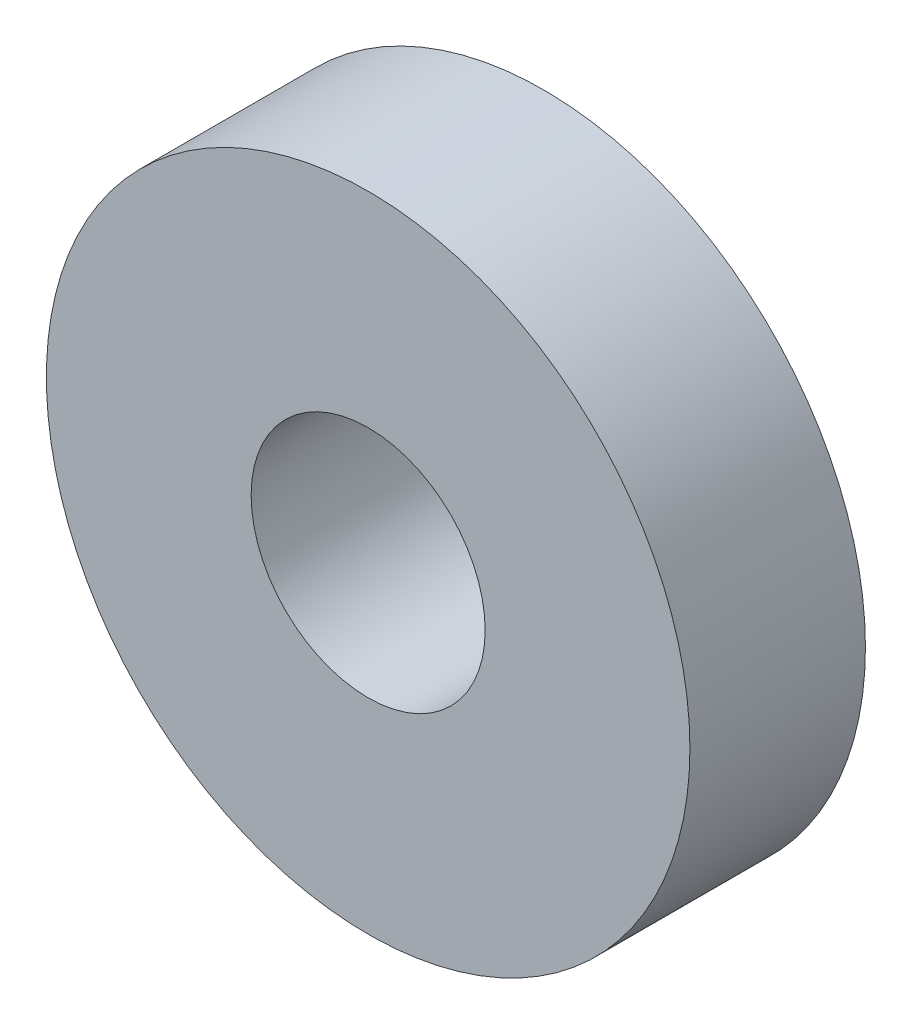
from build123d import *

# Parameters (mm, degrees)
ESQUISSE1_R        = 11
ESQUISSE1_R_2      = 4
BOSS_EXTRU_1_DEPTH = 6


with BuildPart() as part:
    # Esquisse1 → Boss.-Extru.1 (new body)
    with BuildSketch(Plane.XY):
        Circle(ESQUISSE1_R)
        Circle(ESQUISSE1_R_2, mode=Mode.SUBTRACT)
    extrude(amount=BOSS_EXTRU_1_DEPTH)


solid = part.part
